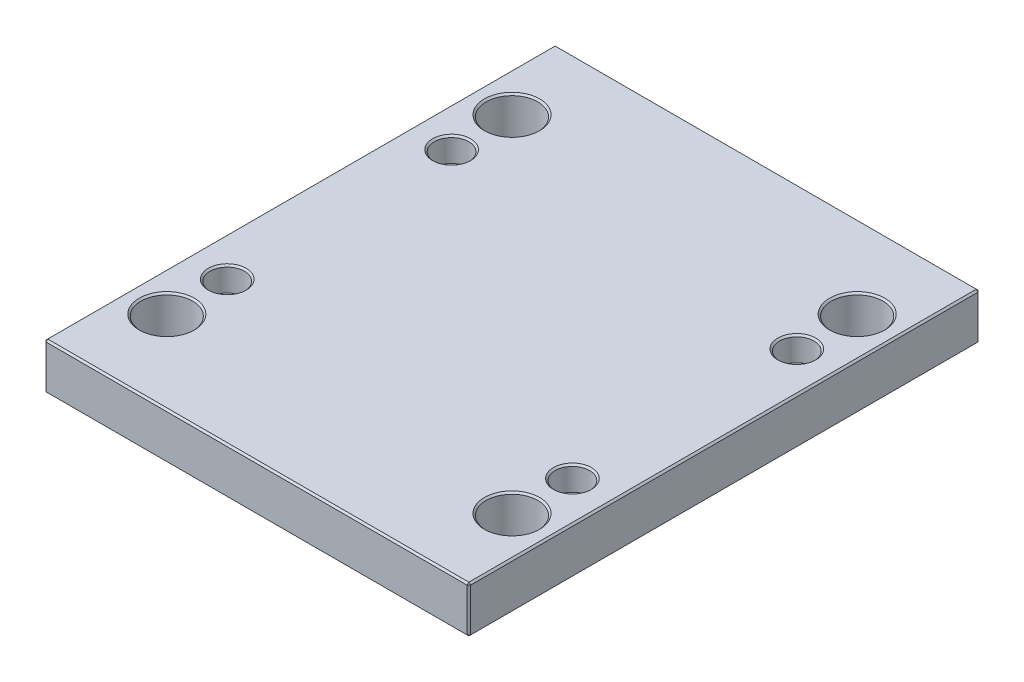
ISO-10303-21;
HEADER;
FILE_DESCRIPTION(('STEP AP214'),'2;1');
FILE_NAME('part.step','',(''),(''),'','','');
FILE_SCHEMA(('AUTOMOTIVE_DESIGN { 1 0 10303 214 1 1 1 1 }'));
ENDSEC;
DATA;
#1=APPLICATION_CONTEXT('core data for automotive mechanical design processes');
#2=APPLICATION_PROTOCOL_DEFINITION('international standard','automotive_design',2000,#1);
#3=PRODUCT_CONTEXT('',#1,'mechanical');
#4=PRODUCT('Part','Part','',(#3));
#5=PRODUCT_RELATED_PRODUCT_CATEGORY('part','',(#4));
#6=PRODUCT_DEFINITION_FORMATION('','',#4);
#7=PRODUCT_DEFINITION_CONTEXT('part definition',#1,'design');
#8=PRODUCT_DEFINITION('design','',#6,#7);
#9=PRODUCT_DEFINITION_SHAPE('','',#8);
#10=(LENGTH_UNIT() NAMED_UNIT(*) SI_UNIT(.MILLI.,.METRE.));
#11=(NAMED_UNIT(*) PLANE_ANGLE_UNIT() SI_UNIT($,.RADIAN.));
#12=(NAMED_UNIT(*) SI_UNIT($,.STERADIAN.) SOLID_ANGLE_UNIT());
#13=UNCERTAINTY_MEASURE_WITH_UNIT(LENGTH_MEASURE(1.E-05),#10,'distance_accuracy_value','');
#14=(GEOMETRIC_REPRESENTATION_CONTEXT(3) GLOBAL_UNCERTAINTY_ASSIGNED_CONTEXT((#13)) GLOBAL_UNIT_ASSIGNED_CONTEXT((#10,
#11,#12)) REPRESENTATION_CONTEXT('',''));
#15=CARTESIAN_POINT('',(0.,0.,0.));
#16=DIRECTION('',(0.,0.,1.));
#17=DIRECTION('',(1.,0.,0.));
#18=AXIS2_PLACEMENT_3D('',#15,#16,#17);
#19=CARTESIAN_POINT('',(-123.,27.,148.));
#20=DIRECTION('',(1.,0.,0.));
#21=DIRECTION('',(0.,0.,-1.));
#22=AXIS2_PLACEMENT_3D('',#19,#20,#21);
#23=PLANE('',#22);
#24=DIRECTION('',(0.,-1.,0.));
#25=VECTOR('',#24,1.);
#26=CARTESIAN_POINT('',(-123.,27.,-147.));
#27=LINE('',#26,#25);
#28=CARTESIAN_POINT('',(-123.,26.,-147.));
#29=VERTEX_POINT('',#28);
#30=CARTESIAN_POINT('',(-123.,0.999999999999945,-147.));
#31=VERTEX_POINT('',#30);
#32=EDGE_CURVE('E115',#29,#31,#27,.T.);
#33=ORIENTED_EDGE('',*,*,#32,.T.);
#34=DIRECTION('',(0.,0.,1.));
#35=VECTOR('',#34,1.);
#36=CARTESIAN_POINT('',(-123.,0.999999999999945,148.));
#37=LINE('',#36,#35);
#38=CARTESIAN_POINT('',(-123.,0.999999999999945,147.));
#39=VERTEX_POINT('',#38);
#40=EDGE_CURVE('E111',#31,#39,#37,.T.);
#41=ORIENTED_EDGE('',*,*,#40,.T.);
#42=DIRECTION('',(0.,1.,0.));
#43=VECTOR('',#42,1.);
#44=CARTESIAN_POINT('',(-123.,27.,147.));
#45=LINE('',#44,#43);
#46=CARTESIAN_POINT('',(-123.,26.,147.));
#47=VERTEX_POINT('',#46);
#48=EDGE_CURVE('E104',#39,#47,#45,.T.);
#49=ORIENTED_EDGE('',*,*,#48,.T.);
#50=DIRECTION('',(0.,0.,-1.));
#51=VECTOR('',#50,1.);
#52=CARTESIAN_POINT('',(-123.,26.,-148.));
#53=LINE('',#52,#51);
#54=EDGE_CURVE('E108',#47,#29,#53,.T.);
#55=ORIENTED_EDGE('',*,*,#54,.T.);
#56=EDGE_LOOP('',(#33,#41,#49,#55));
#57=FACE_BOUND('',#56,.T.);
#58=ADVANCED_FACE('F16',(#57),#23,.F.);
#59=CARTESIAN_POINT('',(123.,27.,148.));
#60=DIRECTION('',(0.,0.,-1.));
#61=DIRECTION('',(-1.,0.,0.));
#62=AXIS2_PLACEMENT_3D('',#59,#60,#61);
#63=PLANE('',#62);
#64=DIRECTION('',(-1.,0.,0.));
#65=VECTOR('',#64,1.);
#66=CARTESIAN_POINT('',(-123.,26.,148.));
#67=LINE('',#66,#65);
#68=CARTESIAN_POINT('',(122.,26.,148.));
#69=VERTEX_POINT('',#68);
#70=CARTESIAN_POINT('',(-122.,26.,148.));
#71=VERTEX_POINT('',#70);
#72=EDGE_CURVE('E170',#69,#71,#67,.T.);
#73=ORIENTED_EDGE('',*,*,#72,.T.);
#74=DIRECTION('',(0.,-1.,0.));
#75=VECTOR('',#74,1.);
#76=CARTESIAN_POINT('',(-122.,27.,148.));
#77=LINE('',#76,#75);
#78=CARTESIAN_POINT('',(-122.,0.999999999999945,148.));
#79=VERTEX_POINT('',#78);
#80=EDGE_CURVE('E123',#71,#79,#77,.T.);
#81=ORIENTED_EDGE('',*,*,#80,.T.);
#82=DIRECTION('',(1.,0.,0.));
#83=VECTOR('',#82,1.);
#84=CARTESIAN_POINT('',(123.,0.999999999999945,148.));
#85=LINE('',#84,#83);
#86=CARTESIAN_POINT('',(122.,0.999999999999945,148.));
#87=VERTEX_POINT('',#86);
#88=EDGE_CURVE('E174',#79,#87,#85,.T.);
#89=ORIENTED_EDGE('',*,*,#88,.T.);
#90=DIRECTION('',(0.,1.,0.));
#91=VECTOR('',#90,1.);
#92=CARTESIAN_POINT('',(122.,27.,148.));
#93=LINE('',#92,#91);
#94=EDGE_CURVE('E172',#87,#69,#93,.T.);
#95=ORIENTED_EDGE('',*,*,#94,.T.);
#96=EDGE_LOOP('',(#73,#81,#89,#95));
#97=FACE_BOUND('',#96,.T.);
#98=ADVANCED_FACE('F413',(#97),#63,.F.);
#99=CARTESIAN_POINT('',(123.,27.,148.));
#100=DIRECTION('',(-1.,0.,0.));
#101=DIRECTION('',(0.,0.,1.));
#102=AXIS2_PLACEMENT_3D('',#99,#100,#101);
#103=PLANE('',#102);
#104=DIRECTION('',(0.,0.,-1.));
#105=VECTOR('',#104,1.);
#106=CARTESIAN_POINT('',(123.,0.999999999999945,148.));
#107=LINE('',#106,#105);
#108=CARTESIAN_POINT('',(123.,0.999999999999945,147.));
#109=VERTEX_POINT('',#108);
#110=CARTESIAN_POINT('',(123.,0.999999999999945,-147.));
#111=VERTEX_POINT('',#110);
#112=EDGE_CURVE('E165',#109,#111,#107,.T.);
#113=ORIENTED_EDGE('',*,*,#112,.T.);
#114=DIRECTION('',(0.,1.,0.));
#115=VECTOR('',#114,1.);
#116=CARTESIAN_POINT('',(123.,27.,-147.));
#117=LINE('',#116,#115);
#118=CARTESIAN_POINT('',(123.,26.,-147.));
#119=VERTEX_POINT('',#118);
#120=EDGE_CURVE('E167',#111,#119,#117,.T.);
#121=ORIENTED_EDGE('',*,*,#120,.T.);
#122=DIRECTION('',(0.,0.,1.));
#123=VECTOR('',#122,1.);
#124=CARTESIAN_POINT('',(123.,26.,148.));
#125=LINE('',#124,#123);
#126=CARTESIAN_POINT('',(123.,26.,147.));
#127=VERTEX_POINT('',#126);
#128=EDGE_CURVE('E161',#119,#127,#125,.T.);
#129=ORIENTED_EDGE('',*,*,#128,.T.);
#130=DIRECTION('',(0.,-1.,0.));
#131=VECTOR('',#130,1.);
#132=CARTESIAN_POINT('',(123.,27.,147.));
#133=LINE('',#132,#131);
#134=EDGE_CURVE('E163',#127,#109,#133,.T.);
#135=ORIENTED_EDGE('',*,*,#134,.T.);
#136=EDGE_LOOP('',(#113,#121,#129,#135));
#137=FACE_BOUND('',#136,.T.);
#138=ADVANCED_FACE('F406',(#137),#103,.F.);
#139=CARTESIAN_POINT('',(123.,27.,-148.));
#140=DIRECTION('',(0.,0.,1.));
#141=DIRECTION('',(1.,0.,0.));
#142=AXIS2_PLACEMENT_3D('',#139,#140,#141);
#143=PLANE('',#142);
#144=DIRECTION('',(0.,-1.,0.));
#145=VECTOR('',#144,1.);
#146=CARTESIAN_POINT('',(122.,27.,-148.));
#147=LINE('',#146,#145);
#148=CARTESIAN_POINT('',(122.,26.,-148.));
#149=VERTEX_POINT('',#148);
#150=CARTESIAN_POINT('',(122.,0.999999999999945,-148.));
#151=VERTEX_POINT('',#150);
#152=EDGE_CURVE('E154',#149,#151,#147,.T.);
#153=ORIENTED_EDGE('',*,*,#152,.T.);
#154=DIRECTION('',(-1.,0.,0.));
#155=VECTOR('',#154,1.);
#156=CARTESIAN_POINT('',(123.,0.999999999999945,-148.));
#157=LINE('',#156,#155);
#158=CARTESIAN_POINT('',(-122.,0.999999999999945,-148.));
#159=VERTEX_POINT('',#158);
#160=EDGE_CURVE('E159',#151,#159,#157,.T.);
#161=ORIENTED_EDGE('',*,*,#160,.T.);
#162=DIRECTION('',(0.,1.,0.));
#163=VECTOR('',#162,1.);
#164=CARTESIAN_POINT('',(-122.,27.,-148.));
#165=LINE('',#164,#163);
#166=CARTESIAN_POINT('',(-122.,26.,-148.));
#167=VERTEX_POINT('',#166);
#168=EDGE_CURVE('E156',#159,#167,#165,.T.);
#169=ORIENTED_EDGE('',*,*,#168,.T.);
#170=DIRECTION('',(1.,0.,0.));
#171=VECTOR('',#170,1.);
#172=CARTESIAN_POINT('',(123.,26.,-148.));
#173=LINE('',#172,#171);
#174=EDGE_CURVE('E152',#167,#149,#173,.T.);
#175=ORIENTED_EDGE('',*,*,#174,.T.);
#176=EDGE_LOOP('',(#153,#161,#169,#175));
#177=FACE_BOUND('',#176,.T.);
#178=ADVANCED_FACE('F431',(#177),#143,.F.);
#179=CARTESIAN_POINT('',(0.,27.,0.));
#180=DIRECTION('',(0.,1.,0.));
#181=DIRECTION('',(0.,0.,1.));
#182=AXIS2_PLACEMENT_3D('',#179,#180,#181);
#183=PLANE('',#182);
#184=CARTESIAN_POINT('',(-100.,27.,100.));
#185=DIRECTION('',(0.,1.,0.));
#186=DIRECTION('',(0.,0.,1.));
#187=AXIS2_PLACEMENT_3D('',#184,#185,#186);
#188=CIRCLE('',#187,16.);
#189=CARTESIAN_POINT('',(-100.,27.,116.));
#190=VERTEX_POINT('',#189);
#191=EDGE_CURVE('E317',#190,#190,#188,.F.);
#192=ORIENTED_EDGE('',*,*,#191,.T.);
#193=EDGE_LOOP('',(#192));
#194=FACE_BOUND('',#193,.T.);
#195=CARTESIAN_POINT('',(100.,27.,100.));
#196=DIRECTION('',(0.,1.,0.));
#197=DIRECTION('',(0.,0.,1.));
#198=AXIS2_PLACEMENT_3D('',#195,#196,#197);
#199=CIRCLE('',#198,16.);
#200=CARTESIAN_POINT('',(100.,27.,116.));
#201=VERTEX_POINT('',#200);
#202=EDGE_CURVE('E314',#201,#201,#199,.F.);
#203=ORIENTED_EDGE('',*,*,#202,.T.);
#204=EDGE_LOOP('',(#203));
#205=FACE_BOUND('',#204,.T.);
#206=CARTESIAN_POINT('',(100.,27.,-100.));
#207=DIRECTION('',(0.,1.,0.));
#208=DIRECTION('',(0.,0.,1.));
#209=AXIS2_PLACEMENT_3D('',#206,#207,#208);
#210=CIRCLE('',#209,16.);
#211=CARTESIAN_POINT('',(100.,27.,-84.));
#212=VERTEX_POINT('',#211);
#213=EDGE_CURVE('E311',#212,#212,#210,.F.);
#214=ORIENTED_EDGE('',*,*,#213,.T.);
#215=EDGE_LOOP('',(#214));
#216=FACE_BOUND('',#215,.T.);
#217=CARTESIAN_POINT('',(-100.,27.,-100.));
#218=DIRECTION('',(0.,1.,0.));
#219=DIRECTION('',(0.,0.,1.));
#220=AXIS2_PLACEMENT_3D('',#217,#218,#219);
#221=CIRCLE('',#220,16.);
#222=CARTESIAN_POINT('',(-100.,27.,-84.));
#223=VERTEX_POINT('',#222);
#224=EDGE_CURVE('E308',#223,#223,#221,.F.);
#225=ORIENTED_EDGE('',*,*,#224,.T.);
#226=EDGE_LOOP('',(#225));
#227=FACE_BOUND('',#226,.T.);
#228=CARTESIAN_POINT('',(-100.,27.,65.));
#229=DIRECTION('',(0.,1.,0.));
#230=DIRECTION('',(0.,0.,1.));
#231=AXIS2_PLACEMENT_3D('',#228,#229,#230);
#232=CIRCLE('',#231,11.);
#233=CARTESIAN_POINT('',(-100.,27.,76.));
#234=VERTEX_POINT('',#233);
#235=EDGE_CURVE('E290',#234,#234,#232,.F.);
#236=ORIENTED_EDGE('',*,*,#235,.T.);
#237=EDGE_LOOP('',(#236));
#238=FACE_BOUND('',#237,.T.);
#239=CARTESIAN_POINT('',(100.,27.,65.));
#240=DIRECTION('',(0.,1.,0.));
#241=DIRECTION('',(0.,0.,1.));
#242=AXIS2_PLACEMENT_3D('',#239,#240,#241);
#243=CIRCLE('',#242,11.);
#244=CARTESIAN_POINT('',(100.,27.,76.));
#245=VERTEX_POINT('',#244);
#246=EDGE_CURVE('E287',#245,#245,#243,.F.);
#247=ORIENTED_EDGE('',*,*,#246,.T.);
#248=EDGE_LOOP('',(#247));
#249=FACE_BOUND('',#248,.T.);
#250=CARTESIAN_POINT('',(100.,27.,-65.));
#251=DIRECTION('',(0.,1.,0.));
#252=DIRECTION('',(0.,0.,1.));
#253=AXIS2_PLACEMENT_3D('',#250,#251,#252);
#254=CIRCLE('',#253,11.);
#255=CARTESIAN_POINT('',(100.,27.,-54.));
#256=VERTEX_POINT('',#255);
#257=EDGE_CURVE('E284',#256,#256,#254,.F.);
#258=ORIENTED_EDGE('',*,*,#257,.T.);
#259=EDGE_LOOP('',(#258));
#260=FACE_BOUND('',#259,.T.);
#261=CARTESIAN_POINT('',(-100.,27.,-65.));
#262=DIRECTION('',(0.,1.,0.));
#263=DIRECTION('',(0.,0.,1.));
#264=AXIS2_PLACEMENT_3D('',#261,#262,#263);
#265=CIRCLE('',#264,11.);
#266=CARTESIAN_POINT('',(-100.,27.,-54.));
#267=VERTEX_POINT('',#266);
#268=EDGE_CURVE('E281',#267,#267,#265,.F.);
#269=ORIENTED_EDGE('',*,*,#268,.T.);
#270=EDGE_LOOP('',(#269));
#271=FACE_BOUND('',#270,.T.);
#272=DIRECTION('',(0.,0.,-1.));
#273=VECTOR('',#272,1.);
#274=CARTESIAN_POINT('',(122.,27.,-148.));
#275=LINE('',#274,#273);
#276=CARTESIAN_POINT('',(122.,27.,147.));
#277=VERTEX_POINT('',#276);
#278=CARTESIAN_POINT('',(122.,27.,-147.));
#279=VERTEX_POINT('',#278);
#280=EDGE_CURVE('E31',#277,#279,#275,.T.);
#281=ORIENTED_EDGE('',*,*,#280,.T.);
#282=DIRECTION('',(-1.,0.,0.));
#283=VECTOR('',#282,1.);
#284=CARTESIAN_POINT('',(-123.,27.,-147.));
#285=LINE('',#284,#283);
#286=CARTESIAN_POINT('',(-122.,27.,-147.));
#287=VERTEX_POINT('',#286);
#288=EDGE_CURVE('E190',#279,#287,#285,.T.);
#289=ORIENTED_EDGE('',*,*,#288,.T.);
#290=DIRECTION('',(0.,0.,1.));
#291=VECTOR('',#290,1.);
#292=CARTESIAN_POINT('',(-122.,27.,148.));
#293=LINE('',#292,#291);
#294=CARTESIAN_POINT('',(-122.,27.,147.));
#295=VERTEX_POINT('',#294);
#296=EDGE_CURVE('E186',#287,#295,#293,.T.);
#297=ORIENTED_EDGE('',*,*,#296,.T.);
#298=DIRECTION('',(1.,0.,0.));
#299=VECTOR('',#298,1.);
#300=CARTESIAN_POINT('',(123.,27.,147.));
#301=LINE('',#300,#299);
#302=EDGE_CURVE('E36',#295,#277,#301,.T.);
#303=ORIENTED_EDGE('',*,*,#302,.T.);
#304=EDGE_LOOP('',(#281,#289,#297,#303));
#305=FACE_BOUND('',#304,.T.);
#306=ADVANCED_FACE('F357',(#194,#205,#216,#227,#238,#249,#260,#271,#305),#183,.T.);
#307=CARTESIAN_POINT('',(0.,0.,0.));
#308=DIRECTION('',(0.,1.,0.));
#309=DIRECTION('',(0.,0.,1.));
#310=AXIS2_PLACEMENT_3D('',#307,#308,#309);
#311=PLANE('',#310);
#312=CARTESIAN_POINT('',(-100.,0.,100.));
#313=DIRECTION('',(0.,1.,0.));
#314=DIRECTION('',(0.,0.,1.));
#315=AXIS2_PLACEMENT_3D('',#312,#313,#314);
#316=CIRCLE('',#315,16.);
#317=CARTESIAN_POINT('',(-100.,0.,116.));
#318=VERTEX_POINT('',#317);
#319=EDGE_CURVE('E329',#318,#318,#316,.T.);
#320=ORIENTED_EDGE('',*,*,#319,.T.);
#321=EDGE_LOOP('',(#320));
#322=FACE_BOUND('',#321,.T.);
#323=CARTESIAN_POINT('',(100.,0.,100.));
#324=DIRECTION('',(0.,1.,0.));
#325=DIRECTION('',(0.,0.,1.));
#326=AXIS2_PLACEMENT_3D('',#323,#324,#325);
#327=CIRCLE('',#326,16.);
#328=CARTESIAN_POINT('',(100.,0.,116.));
#329=VERTEX_POINT('',#328);
#330=EDGE_CURVE('E326',#329,#329,#327,.T.);
#331=ORIENTED_EDGE('',*,*,#330,.T.);
#332=EDGE_LOOP('',(#331));
#333=FACE_BOUND('',#332,.T.);
#334=CARTESIAN_POINT('',(100.,0.,-100.));
#335=DIRECTION('',(0.,1.,0.));
#336=DIRECTION('',(0.,0.,1.));
#337=AXIS2_PLACEMENT_3D('',#334,#335,#336);
#338=CIRCLE('',#337,16.);
#339=CARTESIAN_POINT('',(100.,0.,-84.));
#340=VERTEX_POINT('',#339);
#341=EDGE_CURVE('E323',#340,#340,#338,.T.);
#342=ORIENTED_EDGE('',*,*,#341,.T.);
#343=EDGE_LOOP('',(#342));
#344=FACE_BOUND('',#343,.T.);
#345=CARTESIAN_POINT('',(-100.,0.,-100.));
#346=DIRECTION('',(0.,1.,0.));
#347=DIRECTION('',(0.,0.,1.));
#348=AXIS2_PLACEMENT_3D('',#345,#346,#347);
#349=CIRCLE('',#348,16.);
#350=CARTESIAN_POINT('',(-100.,0.,-84.));
#351=VERTEX_POINT('',#350);
#352=EDGE_CURVE('E320',#351,#351,#349,.T.);
#353=ORIENTED_EDGE('',*,*,#352,.T.);
#354=EDGE_LOOP('',(#353));
#355=FACE_BOUND('',#354,.T.);
#356=CARTESIAN_POINT('',(100.,0.,-65.));
#357=DIRECTION('',(0.,1.,0.));
#358=DIRECTION('',(0.,0.,1.));
#359=AXIS2_PLACEMENT_3D('',#356,#357,#358);
#360=CIRCLE('',#359,8.);
#361=CARTESIAN_POINT('',(100.,0.,-57.));
#362=VERTEX_POINT('',#361);
#363=EDGE_CURVE('E263',#362,#362,#360,.T.);
#364=ORIENTED_EDGE('',*,*,#363,.T.);
#365=EDGE_LOOP('',(#364));
#366=FACE_BOUND('',#365,.T.);
#367=CARTESIAN_POINT('',(100.,0.,65.));
#368=DIRECTION('',(0.,1.,0.));
#369=DIRECTION('',(0.,0.,1.));
#370=AXIS2_PLACEMENT_3D('',#367,#368,#369);
#371=CIRCLE('',#370,8.);
#372=CARTESIAN_POINT('',(100.,0.,73.));
#373=VERTEX_POINT('',#372);
#374=EDGE_CURVE('E260',#373,#373,#371,.T.);
#375=ORIENTED_EDGE('',*,*,#374,.T.);
#376=EDGE_LOOP('',(#375));
#377=FACE_BOUND('',#376,.T.);
#378=CARTESIAN_POINT('',(-100.,0.,65.));
#379=DIRECTION('',(0.,1.,0.));
#380=DIRECTION('',(0.,0.,1.));
#381=AXIS2_PLACEMENT_3D('',#378,#379,#380);
#382=CIRCLE('',#381,8.);
#383=CARTESIAN_POINT('',(-100.,0.,73.));
#384=VERTEX_POINT('',#383);
#385=EDGE_CURVE('E257',#384,#384,#382,.T.);
#386=ORIENTED_EDGE('',*,*,#385,.T.);
#387=EDGE_LOOP('',(#386));
#388=FACE_BOUND('',#387,.T.);
#389=CARTESIAN_POINT('',(-100.,0.,-65.));
#390=DIRECTION('',(0.,1.,0.));
#391=DIRECTION('',(0.,0.,1.));
#392=AXIS2_PLACEMENT_3D('',#389,#390,#391);
#393=CIRCLE('',#392,8.);
#394=CARTESIAN_POINT('',(-100.,0.,-57.));
#395=VERTEX_POINT('',#394);
#396=EDGE_CURVE('E192',#395,#395,#393,.T.);
#397=ORIENTED_EDGE('',*,*,#396,.T.);
#398=EDGE_LOOP('',(#397));
#399=FACE_BOUND('',#398,.T.);
#400=DIRECTION('',(0.,0.,1.));
#401=VECTOR('',#400,1.);
#402=CARTESIAN_POINT('',(122.,0.,0.));
#403=LINE('',#402,#401);
#404=CARTESIAN_POINT('',(122.,0.,-147.));
#405=VERTEX_POINT('',#404);
#406=CARTESIAN_POINT('',(122.,0.,147.));
#407=VERTEX_POINT('',#406);
#408=EDGE_CURVE('E177',#405,#407,#403,.T.);
#409=ORIENTED_EDGE('',*,*,#408,.T.);
#410=DIRECTION('',(-1.,0.,0.));
#411=VECTOR('',#410,1.);
#412=CARTESIAN_POINT('',(0.,0.,147.));
#413=LINE('',#412,#411);
#414=CARTESIAN_POINT('',(-122.,0.,147.));
#415=VERTEX_POINT('',#414);
#416=EDGE_CURVE('E183',#407,#415,#413,.T.);
#417=ORIENTED_EDGE('',*,*,#416,.T.);
#418=DIRECTION('',(0.,0.,-1.));
#419=VECTOR('',#418,1.);
#420=CARTESIAN_POINT('',(-122.,0.,0.));
#421=LINE('',#420,#419);
#422=CARTESIAN_POINT('',(-122.,0.,-147.));
#423=VERTEX_POINT('',#422);
#424=EDGE_CURVE('E181',#415,#423,#421,.T.);
#425=ORIENTED_EDGE('',*,*,#424,.T.);
#426=DIRECTION('',(1.,0.,0.));
#427=VECTOR('',#426,1.);
#428=CARTESIAN_POINT('',(0.,0.,-147.));
#429=LINE('',#428,#427);
#430=EDGE_CURVE('E179',#423,#405,#429,.T.);
#431=ORIENTED_EDGE('',*,*,#430,.T.);
#432=EDGE_LOOP('',(#409,#417,#425,#431));
#433=FACE_BOUND('',#432,.T.);
#434=ADVANCED_FACE('F353',(#322,#333,#344,#355,#366,#377,#388,#399,#433),#311,.F.);
#435=CARTESIAN_POINT('',(123.,27.,147.));
#436=DIRECTION('',(-0.707106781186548,0.,-0.707106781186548));
#437=DIRECTION('',(0.,-1.,0.));
#438=AXIS2_PLACEMENT_3D('',#435,#436,#437);
#439=PLANE('',#438);
#440=DIRECTION('',(-0.707106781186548,0.,0.707106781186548));
#441=VECTOR('',#440,1.);
#442=CARTESIAN_POINT('',(122.,26.,148.));
#443=LINE('',#442,#441);
#444=EDGE_CURVE('E141',#69,#127,#443,.F.);
#445=ORIENTED_EDGE('',*,*,#444,.F.);
#446=ORIENTED_EDGE('',*,*,#94,.F.);
#447=DIRECTION('',(0.707106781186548,0.,-0.707106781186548));
#448=VECTOR('',#447,1.);
#449=CARTESIAN_POINT('',(122.,0.999999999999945,148.));
#450=LINE('',#449,#448);
#451=EDGE_CURVE('E144',#109,#87,#450,.F.);
#452=ORIENTED_EDGE('',*,*,#451,.F.);
#453=ORIENTED_EDGE('',*,*,#134,.F.);
#454=EDGE_LOOP('',(#445,#446,#452,#453));
#455=FACE_BOUND('',#454,.T.);
#456=ADVANCED_FACE('F356',(#455),#439,.F.);
#457=CARTESIAN_POINT('',(122.,26.,148.));
#458=DIRECTION('',(0.577350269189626,0.577350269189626,0.577350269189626));
#459=DIRECTION('',(0.707106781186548,0.,-0.707106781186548));
#460=AXIS2_PLACEMENT_3D('',#457,#458,#459);
#461=PLANE('',#460);
#462=DIRECTION('',(0.,-0.707106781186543,0.707106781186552));
#463=VECTOR('',#462,1.);
#464=CARTESIAN_POINT('',(122.,26.,148.));
#465=LINE('',#464,#463);
#466=EDGE_CURVE('E235',#69,#277,#465,.F.);
#467=ORIENTED_EDGE('',*,*,#466,.F.);
#468=ORIENTED_EDGE('',*,*,#444,.T.);
#469=DIRECTION('',(-0.707106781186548,0.707106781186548,0.));
#470=VECTOR('',#469,1.);
#471=CARTESIAN_POINT('',(122.5,26.5,147.));
#472=LINE('',#471,#470);
#473=EDGE_CURVE('E237',#277,#127,#472,.F.);
#474=ORIENTED_EDGE('',*,*,#473,.F.);
#475=EDGE_LOOP('',(#467,#468,#474));
#476=FACE_BOUND('',#475,.T.);
#477=ADVANCED_FACE('F419',(#476),#461,.T.);
#478=CARTESIAN_POINT('',(122.,0.999999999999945,148.));
#479=DIRECTION('',(0.577350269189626,-0.577350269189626,0.577350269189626));
#480=DIRECTION('',(0.707106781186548,0.,-0.707106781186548));
#481=AXIS2_PLACEMENT_3D('',#478,#479,#480);
#482=PLANE('',#481);
#483=DIRECTION('',(-0.707106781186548,-0.707106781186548,0.));
#484=VECTOR('',#483,1.);
#485=CARTESIAN_POINT('',(122.5,0.499999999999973,147.));
#486=LINE('',#485,#484);
#487=EDGE_CURVE('E229',#109,#407,#486,.T.);
#488=ORIENTED_EDGE('',*,*,#487,.F.);
#489=ORIENTED_EDGE('',*,*,#451,.T.);
#490=DIRECTION('',(0.,0.707106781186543,0.707106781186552));
#491=VECTOR('',#490,1.);
#492=CARTESIAN_POINT('',(122.,0.999999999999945,148.));
#493=LINE('',#492,#491);
#494=EDGE_CURVE('E232',#407,#87,#493,.T.);
#495=ORIENTED_EDGE('',*,*,#494,.F.);
#496=EDGE_LOOP('',(#488,#489,#495));
#497=FACE_BOUND('',#496,.T.);
#498=ADVANCED_FACE('F378',(#497),#482,.T.);
#499=CARTESIAN_POINT('',(122.,27.,0.));
#500=DIRECTION('',(0.707106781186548,0.707106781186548,0.));
#501=DIRECTION('',(0.,0.,1.));
#502=AXIS2_PLACEMENT_3D('',#499,#500,#501);
#503=PLANE('',#502);
#504=ORIENTED_EDGE('',*,*,#473,.T.);
#505=ORIENTED_EDGE('',*,*,#128,.F.);
#506=DIRECTION('',(0.707106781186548,-0.707106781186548,0.));
#507=VECTOR('',#506,1.);
#508=CARTESIAN_POINT('',(123.,26.,-147.));
#509=LINE('',#508,#507);
#510=EDGE_CURVE('E224',#279,#119,#509,.T.);
#511=ORIENTED_EDGE('',*,*,#510,.F.);
#512=ORIENTED_EDGE('',*,*,#280,.F.);
#513=EDGE_LOOP('',(#504,#505,#511,#512));
#514=FACE_BOUND('',#513,.T.);
#515=ADVANCED_FACE('F421',(#514),#503,.T.);
#516=CARTESIAN_POINT('',(0.,27.,147.));
#517=DIRECTION('',(0.,0.707106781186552,0.707106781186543));
#518=DIRECTION('',(-1.,0.,0.));
#519=AXIS2_PLACEMENT_3D('',#516,#517,#518);
#520=PLANE('',#519);
#521=ORIENTED_EDGE('',*,*,#466,.T.);
#522=ORIENTED_EDGE('',*,*,#302,.F.);
#523=DIRECTION('',(0.,0.707106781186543,-0.707106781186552));
#524=VECTOR('',#523,1.);
#525=CARTESIAN_POINT('',(-122.,26.5,147.5));
#526=LINE('',#525,#524);
#527=EDGE_CURVE('E127',#71,#295,#526,.T.);
#528=ORIENTED_EDGE('',*,*,#527,.F.);
#529=ORIENTED_EDGE('',*,*,#72,.F.);
#530=EDGE_LOOP('',(#521,#522,#528,#529));
#531=FACE_BOUND('',#530,.T.);
#532=ADVANCED_FACE('F416',(#531),#520,.T.);
#533=CARTESIAN_POINT('',(-122.,27.,148.));
#534=DIRECTION('',(0.707106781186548,0.,-0.707106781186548));
#535=DIRECTION('',(0.,-1.,0.));
#536=AXIS2_PLACEMENT_3D('',#533,#534,#535);
#537=PLANE('',#536);
#538=DIRECTION('',(0.707106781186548,0.,0.707106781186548));
#539=VECTOR('',#538,1.);
#540=CARTESIAN_POINT('',(-122.,0.999999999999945,148.));
#541=LINE('',#540,#539);
#542=EDGE_CURVE('E128',#79,#39,#541,.F.);
#543=ORIENTED_EDGE('',*,*,#542,.F.);
#544=ORIENTED_EDGE('',*,*,#80,.F.);
#545=DIRECTION('',(-0.707106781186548,0.,-0.707106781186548));
#546=VECTOR('',#545,1.);
#547=CARTESIAN_POINT('',(-123.,26.,147.));
#548=LINE('',#547,#546);
#549=EDGE_CURVE('E119',#47,#71,#548,.F.);
#550=ORIENTED_EDGE('',*,*,#549,.F.);
#551=ORIENTED_EDGE('',*,*,#48,.F.);
#552=EDGE_LOOP('',(#543,#544,#550,#551));
#553=FACE_BOUND('',#552,.T.);
#554=ADVANCED_FACE('F121',(#553),#537,.F.);
#555=CARTESIAN_POINT('',(123.,0.999999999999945,148.));
#556=DIRECTION('',(0.,0.707106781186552,-0.707106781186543));
#557=DIRECTION('',(1.,0.,0.));
#558=AXIS2_PLACEMENT_3D('',#555,#556,#557);
#559=PLANE('',#558);
#560=ORIENTED_EDGE('',*,*,#494,.T.);
#561=ORIENTED_EDGE('',*,*,#88,.F.);
#562=DIRECTION('',(0.,-0.707106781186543,-0.707106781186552));
#563=VECTOR('',#562,1.);
#564=CARTESIAN_POINT('',(-122.,0.999999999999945,148.));
#565=LINE('',#564,#563);
#566=EDGE_CURVE('E220',#415,#79,#565,.F.);
#567=ORIENTED_EDGE('',*,*,#566,.F.);
#568=ORIENTED_EDGE('',*,*,#416,.F.);
#569=EDGE_LOOP('',(#560,#561,#567,#568));
#570=FACE_BOUND('',#569,.T.);
#571=ADVANCED_FACE('F383',(#570),#559,.F.);
#572=CARTESIAN_POINT('',(123.,0.999999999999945,148.));
#573=DIRECTION('',(-0.707106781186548,0.707106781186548,0.));
#574=DIRECTION('',(0.,0.,-1.));
#575=AXIS2_PLACEMENT_3D('',#572,#573,#574);
#576=PLANE('',#575);
#577=ORIENTED_EDGE('',*,*,#487,.T.);
#578=ORIENTED_EDGE('',*,*,#408,.F.);
#579=DIRECTION('',(0.707106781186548,0.707106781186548,0.));
#580=VECTOR('',#579,1.);
#581=CARTESIAN_POINT('',(122.5,0.499999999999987,-147.));
#582=LINE('',#581,#580);
#583=EDGE_CURVE('E217',#111,#405,#582,.F.);
#584=ORIENTED_EDGE('',*,*,#583,.F.);
#585=ORIENTED_EDGE('',*,*,#112,.F.);
#586=EDGE_LOOP('',(#577,#578,#584,#585));
#587=FACE_BOUND('',#586,.T.);
#588=ADVANCED_FACE('F376',(#587),#576,.F.);
#589=CARTESIAN_POINT('',(122.,27.,-148.));
#590=DIRECTION('',(-0.707106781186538,0.,0.707106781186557));
#591=DIRECTION('',(0.,-1.,0.));
#592=AXIS2_PLACEMENT_3D('',#589,#590,#591);
#593=PLANE('',#592);
#594=DIRECTION('',(0.707106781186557,0.,0.707106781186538));
#595=VECTOR('',#594,1.);
#596=CARTESIAN_POINT('',(123.,26.,-147.));
#597=LINE('',#596,#595);
#598=EDGE_CURVE('E226',#119,#149,#597,.F.);
#599=ORIENTED_EDGE('',*,*,#598,.F.);
#600=ORIENTED_EDGE('',*,*,#120,.F.);
#601=DIRECTION('',(-0.707106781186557,0.,-0.707106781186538));
#602=VECTOR('',#601,1.);
#603=CARTESIAN_POINT('',(122.,0.999999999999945,-148.));
#604=LINE('',#603,#602);
#605=EDGE_CURVE('E214',#151,#111,#604,.F.);
#606=ORIENTED_EDGE('',*,*,#605,.F.);
#607=ORIENTED_EDGE('',*,*,#152,.F.);
#608=EDGE_LOOP('',(#599,#600,#606,#607));
#609=FACE_BOUND('',#608,.T.);
#610=ADVANCED_FACE('F403',(#609),#593,.F.);
#611=CARTESIAN_POINT('',(123.,26.,-147.));
#612=DIRECTION('',(0.577350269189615,0.577350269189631,-0.577350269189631));
#613=DIRECTION('',(0.,0.707106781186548,0.707106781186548));
#614=AXIS2_PLACEMENT_3D('',#611,#612,#613);
#615=PLANE('',#614);
#616=ORIENTED_EDGE('',*,*,#510,.T.);
#617=ORIENTED_EDGE('',*,*,#598,.T.);
#618=DIRECTION('',(0.,0.707106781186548,0.707106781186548));
#619=VECTOR('',#618,1.);
#620=CARTESIAN_POINT('',(122.,26.5,-147.5));
#621=LINE('',#620,#619);
#622=EDGE_CURVE('E135',#279,#149,#621,.F.);
#623=ORIENTED_EDGE('',*,*,#622,.F.);
#624=EDGE_LOOP('',(#616,#617,#623));
#625=FACE_BOUND('',#624,.T.);
#626=ADVANCED_FACE('F425',(#625),#615,.T.);
#627=CARTESIAN_POINT('',(-123.,26.,147.));
#628=DIRECTION('',(-0.577350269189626,0.577350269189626,0.577350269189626));
#629=DIRECTION('',(0.707106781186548,0.,0.707106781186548));
#630=AXIS2_PLACEMENT_3D('',#627,#628,#629);
#631=PLANE('',#630);
#632=ORIENTED_EDGE('',*,*,#549,.T.);
#633=ORIENTED_EDGE('',*,*,#527,.T.);
#634=DIRECTION('',(-0.707106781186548,-0.707106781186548,0.));
#635=VECTOR('',#634,1.);
#636=CARTESIAN_POINT('',(-123.,26.,147.));
#637=LINE('',#636,#635);
#638=EDGE_CURVE('E131',#47,#295,#637,.F.);
#639=ORIENTED_EDGE('',*,*,#638,.F.);
#640=EDGE_LOOP('',(#632,#633,#639));
#641=FACE_BOUND('',#640,.T.);
#642=ADVANCED_FACE('F132',(#641),#631,.T.);
#643=CARTESIAN_POINT('',(-122.,0.999999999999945,148.));
#644=DIRECTION('',(-0.577350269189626,-0.577350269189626,0.577350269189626));
#645=DIRECTION('',(0.707106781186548,0.,0.707106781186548));
#646=AXIS2_PLACEMENT_3D('',#643,#644,#645);
#647=PLANE('',#646);
#648=ORIENTED_EDGE('',*,*,#566,.T.);
#649=ORIENTED_EDGE('',*,*,#542,.T.);
#650=DIRECTION('',(-0.707106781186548,0.707106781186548,0.));
#651=VECTOR('',#650,1.);
#652=CARTESIAN_POINT('',(-122.5,0.499999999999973,147.));
#653=LINE('',#652,#651);
#654=EDGE_CURVE('E136',#415,#39,#653,.T.);
#655=ORIENTED_EDGE('',*,*,#654,.F.);
#656=EDGE_LOOP('',(#648,#649,#655));
#657=FACE_BOUND('',#656,.T.);
#658=ADVANCED_FACE('F386',(#657),#647,.T.);
#659=CARTESIAN_POINT('',(122.,0.999999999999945,-148.));
#660=DIRECTION('',(0.577350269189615,-0.577350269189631,-0.577350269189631));
#661=DIRECTION('',(0.,0.707106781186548,-0.707106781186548));
#662=AXIS2_PLACEMENT_3D('',#659,#660,#661);
#663=PLANE('',#662);
#664=ORIENTED_EDGE('',*,*,#605,.T.);
#665=ORIENTED_EDGE('',*,*,#583,.T.);
#666=DIRECTION('',(0.,-0.707106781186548,0.707106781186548));
#667=VECTOR('',#666,1.);
#668=CARTESIAN_POINT('',(122.,0.999999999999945,-148.));
#669=LINE('',#668,#667);
#670=EDGE_CURVE('E207',#151,#405,#669,.T.);
#671=ORIENTED_EDGE('',*,*,#670,.F.);
#672=EDGE_LOOP('',(#664,#665,#671));
#673=FACE_BOUND('',#672,.T.);
#674=ADVANCED_FACE('F397',(#673),#663,.T.);
#675=CARTESIAN_POINT('',(0.,27.,-147.));
#676=DIRECTION('',(0.,0.707106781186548,-0.707106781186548));
#677=DIRECTION('',(1.,0.,0.));
#678=AXIS2_PLACEMENT_3D('',#675,#676,#677);
#679=PLANE('',#678);
#680=ORIENTED_EDGE('',*,*,#622,.T.);
#681=ORIENTED_EDGE('',*,*,#174,.F.);
#682=DIRECTION('',(0.,-0.707106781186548,-0.707106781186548));
#683=VECTOR('',#682,1.);
#684=CARTESIAN_POINT('',(-122.,26.,-148.));
#685=LINE('',#684,#683);
#686=EDGE_CURVE('E204',#287,#167,#685,.T.);
#687=ORIENTED_EDGE('',*,*,#686,.F.);
#688=ORIENTED_EDGE('',*,*,#288,.F.);
#689=EDGE_LOOP('',(#680,#681,#687,#688));
#690=FACE_BOUND('',#689,.T.);
#691=ADVANCED_FACE('F429',(#690),#679,.T.);
#692=CARTESIAN_POINT('',(-122.,27.,0.));
#693=DIRECTION('',(-0.707106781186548,0.707106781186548,0.));
#694=DIRECTION('',(0.,0.,-1.));
#695=AXIS2_PLACEMENT_3D('',#692,#693,#694);
#696=PLANE('',#695);
#697=ORIENTED_EDGE('',*,*,#638,.T.);
#698=ORIENTED_EDGE('',*,*,#296,.F.);
#699=DIRECTION('',(0.707106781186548,0.707106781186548,0.));
#700=VECTOR('',#699,1.);
#701=CARTESIAN_POINT('',(-122.5,26.5,-147.));
#702=LINE('',#701,#700);
#703=EDGE_CURVE('E139',#29,#287,#702,.T.);
#704=ORIENTED_EDGE('',*,*,#703,.F.);
#705=ORIENTED_EDGE('',*,*,#54,.F.);
#706=EDGE_LOOP('',(#697,#698,#704,#705));
#707=FACE_BOUND('',#706,.T.);
#708=ADVANCED_FACE('F138',(#707),#696,.T.);
#709=CARTESIAN_POINT('',(-123.,0.999999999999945,148.));
#710=DIRECTION('',(0.707106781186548,0.707106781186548,0.));
#711=DIRECTION('',(0.,0.,1.));
#712=AXIS2_PLACEMENT_3D('',#709,#710,#711);
#713=PLANE('',#712);
#714=ORIENTED_EDGE('',*,*,#654,.T.);
#715=ORIENTED_EDGE('',*,*,#40,.F.);
#716=DIRECTION('',(0.707106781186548,-0.707106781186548,0.));
#717=VECTOR('',#716,1.);
#718=CARTESIAN_POINT('',(-123.,0.999999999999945,-147.));
#719=LINE('',#718,#717);
#720=EDGE_CURVE('E200',#423,#31,#719,.F.);
#721=ORIENTED_EDGE('',*,*,#720,.F.);
#722=ORIENTED_EDGE('',*,*,#424,.F.);
#723=EDGE_LOOP('',(#714,#715,#721,#722));
#724=FACE_BOUND('',#723,.T.);
#725=ADVANCED_FACE('F388',(#724),#713,.F.);
#726=CARTESIAN_POINT('',(123.,0.999999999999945,-148.));
#727=DIRECTION('',(0.,0.707106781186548,0.707106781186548));
#728=DIRECTION('',(-1.,0.,0.));
#729=AXIS2_PLACEMENT_3D('',#726,#727,#728);
#730=PLANE('',#729);
#731=ORIENTED_EDGE('',*,*,#670,.T.);
#732=ORIENTED_EDGE('',*,*,#430,.F.);
#733=DIRECTION('',(0.,0.707106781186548,-0.707106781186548));
#734=VECTOR('',#733,1.);
#735=CARTESIAN_POINT('',(-122.,0.499999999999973,-147.5));
#736=LINE('',#735,#734);
#737=EDGE_CURVE('E197',#159,#423,#736,.F.);
#738=ORIENTED_EDGE('',*,*,#737,.F.);
#739=ORIENTED_EDGE('',*,*,#160,.F.);
#740=EDGE_LOOP('',(#731,#732,#738,#739));
#741=FACE_BOUND('',#740,.T.);
#742=ADVANCED_FACE('F392',(#741),#730,.F.);
#743=CARTESIAN_POINT('',(-122.,26.,-148.));
#744=DIRECTION('',(-0.577350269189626,0.577350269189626,-0.577350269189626));
#745=DIRECTION('',(-0.707106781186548,0.,0.707106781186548));
#746=AXIS2_PLACEMENT_3D('',#743,#744,#745);
#747=PLANE('',#746);
#748=ORIENTED_EDGE('',*,*,#703,.T.);
#749=ORIENTED_EDGE('',*,*,#686,.T.);
#750=DIRECTION('',(0.707106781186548,0.,-0.707106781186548));
#751=VECTOR('',#750,1.);
#752=CARTESIAN_POINT('',(-122.,26.,-148.));
#753=LINE('',#752,#751);
#754=EDGE_CURVE('E195',#29,#167,#753,.T.);
#755=ORIENTED_EDGE('',*,*,#754,.F.);
#756=EDGE_LOOP('',(#748,#749,#755));
#757=FACE_BOUND('',#756,.T.);
#758=ADVANCED_FACE('F460',(#757),#747,.T.);
#759=CARTESIAN_POINT('',(-123.,0.999999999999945,-147.));
#760=DIRECTION('',(-0.577350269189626,-0.577350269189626,-0.577350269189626));
#761=DIRECTION('',(-0.707106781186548,0.,0.707106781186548));
#762=AXIS2_PLACEMENT_3D('',#759,#760,#761);
#763=PLANE('',#762);
#764=ORIENTED_EDGE('',*,*,#737,.T.);
#765=ORIENTED_EDGE('',*,*,#720,.T.);
#766=DIRECTION('',(-0.707106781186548,0.,0.707106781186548));
#767=VECTOR('',#766,1.);
#768=CARTESIAN_POINT('',(-123.,0.999999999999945,-147.));
#769=LINE('',#768,#767);
#770=EDGE_CURVE('E193',#159,#31,#769,.T.);
#771=ORIENTED_EDGE('',*,*,#770,.F.);
#772=EDGE_LOOP('',(#764,#765,#771));
#773=FACE_BOUND('',#772,.T.);
#774=ADVANCED_FACE('F456',(#773),#763,.T.);
#775=CARTESIAN_POINT('',(-123.,27.,-147.));
#776=DIRECTION('',(0.707106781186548,0.,0.707106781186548));
#777=DIRECTION('',(0.,-1.,0.));
#778=AXIS2_PLACEMENT_3D('',#775,#776,#777);
#779=PLANE('',#778);
#780=ORIENTED_EDGE('',*,*,#754,.T.);
#781=ORIENTED_EDGE('',*,*,#168,.F.);
#782=ORIENTED_EDGE('',*,*,#770,.T.);
#783=ORIENTED_EDGE('',*,*,#32,.F.);
#784=EDGE_LOOP('',(#780,#781,#782,#783));
#785=FACE_BOUND('',#784,.T.);
#786=ADVANCED_FACE('F452',(#785),#779,.F.);
#787=CARTESIAN_POINT('',(-100.,13.,-65.));
#788=DIRECTION('',(0.,1.,0.));
#789=DIRECTION('',(0.,0.,1.));
#790=AXIS2_PLACEMENT_3D('',#787,#788,#789);
#791=CYLINDRICAL_SURFACE('',#790,10.);
#792=CARTESIAN_POINT('',(-100.,26.,-65.));
#793=DIRECTION('',(0.,1.,0.));
#794=DIRECTION('',(0.,0.,1.));
#795=AXIS2_PLACEMENT_3D('',#792,#793,#794);
#796=CIRCLE('',#795,10.);
#797=CARTESIAN_POINT('',(-100.,26.,-55.));
#798=VERTEX_POINT('',#797);
#799=EDGE_CURVE('E299',#798,#798,#796,.T.);
#800=ORIENTED_EDGE('',*,*,#799,.T.);
#801=EDGE_LOOP('',(#800));
#802=FACE_BOUND('',#801,.T.);
#803=CARTESIAN_POINT('',(-100.,13.,-65.));
#804=DIRECTION('',(0.,1.,0.));
#805=DIRECTION('',(0.,0.,1.));
#806=AXIS2_PLACEMENT_3D('',#803,#804,#805);
#807=CIRCLE('',#806,10.);
#808=CARTESIAN_POINT('',(-100.,13.,-55.));
#809=VERTEX_POINT('',#808);
#810=EDGE_CURVE('E147',#809,#809,#807,.T.);
#811=ORIENTED_EDGE('',*,*,#810,.F.);
#812=EDGE_LOOP('',(#811));
#813=FACE_BOUND('',#812,.T.);
#814=ADVANCED_FACE('F455',(#802,#813),#791,.F.);
#815=CARTESIAN_POINT('',(-100.,13.,-65.));
#816=DIRECTION('',(0.,1.,0.));
#817=DIRECTION('',(0.,0.,1.));
#818=AXIS2_PLACEMENT_3D('',#815,#816,#817);
#819=PLANE('',#818);
#820=CARTESIAN_POINT('',(-100.,13.,-65.));
#821=DIRECTION('',(0.,1.,0.));
#822=DIRECTION('',(0.,0.,1.));
#823=AXIS2_PLACEMENT_3D('',#820,#821,#822);
#824=CIRCLE('',#823,7.);
#825=CARTESIAN_POINT('',(-100.,13.,-58.));
#826=VERTEX_POINT('',#825);
#827=EDGE_CURVE('E251',#826,#826,#824,.T.);
#828=ORIENTED_EDGE('',*,*,#827,.F.);
#829=EDGE_LOOP('',(#828));
#830=FACE_BOUND('',#829,.T.);
#831=ORIENTED_EDGE('',*,*,#810,.T.);
#832=EDGE_LOOP('',(#831));
#833=FACE_BOUND('',#832,.T.);
#834=ADVANCED_FACE('F602',(#830,#833),#819,.T.);
#835=CARTESIAN_POINT('',(100.,13.,-65.));
#836=DIRECTION('',(0.,1.,0.));
#837=DIRECTION('',(0.,0.,1.));
#838=AXIS2_PLACEMENT_3D('',#835,#836,#837);
#839=CYLINDRICAL_SURFACE('',#838,10.);
#840=CARTESIAN_POINT('',(100.,26.,-65.));
#841=DIRECTION('',(0.,1.,0.));
#842=DIRECTION('',(0.,0.,1.));
#843=AXIS2_PLACEMENT_3D('',#840,#841,#842);
#844=CIRCLE('',#843,10.);
#845=CARTESIAN_POINT('',(100.,26.,-55.));
#846=VERTEX_POINT('',#845);
#847=EDGE_CURVE('E296',#846,#846,#844,.T.);
#848=ORIENTED_EDGE('',*,*,#847,.T.);
#849=EDGE_LOOP('',(#848));
#850=FACE_BOUND('',#849,.T.);
#851=CARTESIAN_POINT('',(100.,13.,-65.));
#852=DIRECTION('',(0.,1.,0.));
#853=DIRECTION('',(0.,0.,1.));
#854=AXIS2_PLACEMENT_3D('',#851,#852,#853);
#855=CIRCLE('',#854,10.);
#856=CARTESIAN_POINT('',(100.,13.,-55.));
#857=VERTEX_POINT('',#856);
#858=EDGE_CURVE('E630',#857,#857,#855,.T.);
#859=ORIENTED_EDGE('',*,*,#858,.F.);
#860=EDGE_LOOP('',(#859));
#861=FACE_BOUND('',#860,.T.);
#862=ADVANCED_FACE('F598',(#850,#861),#839,.F.);
#863=CARTESIAN_POINT('',(100.,13.,-65.));
#864=DIRECTION('',(0.,1.,0.));
#865=DIRECTION('',(0.,0.,1.));
#866=AXIS2_PLACEMENT_3D('',#863,#864,#865);
#867=PLANE('',#866);
#868=CARTESIAN_POINT('',(100.,13.,-65.));
#869=DIRECTION('',(0.,1.,0.));
#870=DIRECTION('',(0.,0.,1.));
#871=AXIS2_PLACEMENT_3D('',#868,#869,#870);
#872=CIRCLE('',#871,7.);
#873=CARTESIAN_POINT('',(100.,13.,-58.));
#874=VERTEX_POINT('',#873);
#875=EDGE_CURVE('E248',#874,#874,#872,.T.);
#876=ORIENTED_EDGE('',*,*,#875,.F.);
#877=EDGE_LOOP('',(#876));
#878=FACE_BOUND('',#877,.T.);
#879=ORIENTED_EDGE('',*,*,#858,.T.);
#880=EDGE_LOOP('',(#879));
#881=FACE_BOUND('',#880,.T.);
#882=ADVANCED_FACE('F594',(#878,#881),#867,.T.);
#883=CARTESIAN_POINT('',(100.,13.,65.));
#884=DIRECTION('',(0.,1.,0.));
#885=DIRECTION('',(0.,0.,1.));
#886=AXIS2_PLACEMENT_3D('',#883,#884,#885);
#887=CYLINDRICAL_SURFACE('',#886,10.);
#888=CARTESIAN_POINT('',(100.,26.,65.));
#889=DIRECTION('',(0.,1.,0.));
#890=DIRECTION('',(0.,0.,1.));
#891=AXIS2_PLACEMENT_3D('',#888,#889,#890);
#892=CIRCLE('',#891,10.);
#893=CARTESIAN_POINT('',(100.,26.,75.));
#894=VERTEX_POINT('',#893);
#895=EDGE_CURVE('E293',#894,#894,#892,.T.);
#896=ORIENTED_EDGE('',*,*,#895,.T.);
#897=EDGE_LOOP('',(#896));
#898=FACE_BOUND('',#897,.T.);
#899=CARTESIAN_POINT('',(100.,13.,65.));
#900=DIRECTION('',(0.,1.,0.));
#901=DIRECTION('',(0.,0.,1.));
#902=AXIS2_PLACEMENT_3D('',#899,#900,#901);
#903=CIRCLE('',#902,10.);
#904=CARTESIAN_POINT('',(100.,13.,75.));
#905=VERTEX_POINT('',#904);
#906=EDGE_CURVE('E632',#905,#905,#903,.T.);
#907=ORIENTED_EDGE('',*,*,#906,.F.);
#908=EDGE_LOOP('',(#907));
#909=FACE_BOUND('',#908,.T.);
#910=ADVANCED_FACE('F597',(#898,#909),#887,.F.);
#911=CARTESIAN_POINT('',(100.,13.,65.));
#912=DIRECTION('',(0.,1.,0.));
#913=DIRECTION('',(0.,0.,1.));
#914=AXIS2_PLACEMENT_3D('',#911,#912,#913);
#915=PLANE('',#914);
#916=CARTESIAN_POINT('',(100.,13.,65.));
#917=DIRECTION('',(0.,1.,0.));
#918=DIRECTION('',(0.,0.,1.));
#919=AXIS2_PLACEMENT_3D('',#916,#917,#918);
#920=CIRCLE('',#919,7.);
#921=CARTESIAN_POINT('',(100.,13.,72.));
#922=VERTEX_POINT('',#921);
#923=EDGE_CURVE('E245',#922,#922,#920,.T.);
#924=ORIENTED_EDGE('',*,*,#923,.F.);
#925=EDGE_LOOP('',(#924));
#926=FACE_BOUND('',#925,.T.);
#927=ORIENTED_EDGE('',*,*,#906,.T.);
#928=EDGE_LOOP('',(#927));
#929=FACE_BOUND('',#928,.T.);
#930=ADVANCED_FACE('F604',(#926,#929),#915,.T.);
#931=CARTESIAN_POINT('',(-100.,13.,65.));
#932=DIRECTION('',(0.,1.,0.));
#933=DIRECTION('',(0.,0.,1.));
#934=AXIS2_PLACEMENT_3D('',#931,#932,#933);
#935=CYLINDRICAL_SURFACE('',#934,10.);
#936=CARTESIAN_POINT('',(-100.,26.,65.));
#937=DIRECTION('',(0.,1.,0.));
#938=DIRECTION('',(0.,0.,1.));
#939=AXIS2_PLACEMENT_3D('',#936,#937,#938);
#940=CIRCLE('',#939,10.);
#941=CARTESIAN_POINT('',(-100.,26.,75.));
#942=VERTEX_POINT('',#941);
#943=EDGE_CURVE('E278',#942,#942,#940,.T.);
#944=ORIENTED_EDGE('',*,*,#943,.T.);
#945=EDGE_LOOP('',(#944));
#946=FACE_BOUND('',#945,.T.);
#947=CARTESIAN_POINT('',(-100.,13.,65.));
#948=DIRECTION('',(0.,1.,0.));
#949=DIRECTION('',(0.,0.,1.));
#950=AXIS2_PLACEMENT_3D('',#947,#948,#949);
#951=CIRCLE('',#950,10.);
#952=CARTESIAN_POINT('',(-100.,13.,75.));
#953=VERTEX_POINT('',#952);
#954=EDGE_CURVE('E254',#953,#953,#951,.T.);
#955=ORIENTED_EDGE('',*,*,#954,.F.);
#956=EDGE_LOOP('',(#955));
#957=FACE_BOUND('',#956,.T.);
#958=ADVANCED_FACE('F607',(#946,#957),#935,.F.);
#959=CARTESIAN_POINT('',(-100.,13.,65.));
#960=DIRECTION('',(0.,1.,0.));
#961=DIRECTION('',(0.,0.,1.));
#962=AXIS2_PLACEMENT_3D('',#959,#960,#961);
#963=PLANE('',#962);
#964=CARTESIAN_POINT('',(-100.,13.,65.));
#965=DIRECTION('',(0.,1.,0.));
#966=DIRECTION('',(0.,0.,1.));
#967=AXIS2_PLACEMENT_3D('',#964,#965,#966);
#968=CIRCLE('',#967,7.);
#969=CARTESIAN_POINT('',(-100.,13.,72.));
#970=VERTEX_POINT('',#969);
#971=EDGE_CURVE('E242',#970,#970,#968,.T.);
#972=ORIENTED_EDGE('',*,*,#971,.F.);
#973=EDGE_LOOP('',(#972));
#974=FACE_BOUND('',#973,.T.);
#975=ORIENTED_EDGE('',*,*,#954,.T.);
#976=EDGE_LOOP('',(#975));
#977=FACE_BOUND('',#976,.T.);
#978=ADVANCED_FACE('F589',(#974,#977),#963,.T.);
#979=CARTESIAN_POINT('',(-100.,0.,65.));
#980=DIRECTION('',(0.,1.,0.));
#981=DIRECTION('',(0.,0.,1.));
#982=AXIS2_PLACEMENT_3D('',#979,#980,#981);
#983=CYLINDRICAL_SURFACE('',#982,7.);
#984=CARTESIAN_POINT('',(-100.,1.0000000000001,65.));
#985=DIRECTION('',(0.,1.,0.));
#986=DIRECTION('',(0.,0.,1.));
#987=AXIS2_PLACEMENT_3D('',#984,#985,#986);
#988=CIRCLE('',#987,7.);
#989=CARTESIAN_POINT('',(-100.,1.0000000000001,72.));
#990=VERTEX_POINT('',#989);
#991=EDGE_CURVE('E272',#990,#990,#988,.F.);
#992=ORIENTED_EDGE('',*,*,#991,.T.);
#993=EDGE_LOOP('',(#992));
#994=FACE_BOUND('',#993,.T.);
#995=ORIENTED_EDGE('',*,*,#971,.T.);
#996=EDGE_LOOP('',(#995));
#997=FACE_BOUND('',#996,.T.);
#998=ADVANCED_FACE('F585',(#994,#997),#983,.F.);
#999=CARTESIAN_POINT('',(100.,0.,65.));
#1000=DIRECTION('',(0.,1.,0.));
#1001=DIRECTION('',(0.,0.,1.));
#1002=AXIS2_PLACEMENT_3D('',#999,#1000,#1001);
#1003=CYLINDRICAL_SURFACE('',#1002,7.);
#1004=CARTESIAN_POINT('',(100.,1.0000000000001,65.));
#1005=DIRECTION('',(0.,1.,0.));
#1006=DIRECTION('',(0.,0.,1.));
#1007=AXIS2_PLACEMENT_3D('',#1004,#1005,#1006);
#1008=CIRCLE('',#1007,7.);
#1009=CARTESIAN_POINT('',(100.,1.0000000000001,72.));
#1010=VERTEX_POINT('',#1009);
#1011=EDGE_CURVE('E269',#1010,#1010,#1008,.F.);
#1012=ORIENTED_EDGE('',*,*,#1011,.T.);
#1013=EDGE_LOOP('',(#1012));
#1014=FACE_BOUND('',#1013,.T.);
#1015=ORIENTED_EDGE('',*,*,#923,.T.);
#1016=EDGE_LOOP('',(#1015));
#1017=FACE_BOUND('',#1016,.T.);
#1018=ADVANCED_FACE('F581',(#1014,#1017),#1003,.F.);
#1019=CARTESIAN_POINT('',(100.,0.,-65.));
#1020=DIRECTION('',(0.,1.,0.));
#1021=DIRECTION('',(0.,0.,1.));
#1022=AXIS2_PLACEMENT_3D('',#1019,#1020,#1021);
#1023=CYLINDRICAL_SURFACE('',#1022,7.);
#1024=CARTESIAN_POINT('',(100.,0.999999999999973,-65.));
#1025=DIRECTION('',(0.,1.,0.));
#1026=DIRECTION('',(0.,0.,1.));
#1027=AXIS2_PLACEMENT_3D('',#1024,#1025,#1026);
#1028=CIRCLE('',#1027,7.);
#1029=CARTESIAN_POINT('',(100.,0.999999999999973,-58.));
#1030=VERTEX_POINT('',#1029);
#1031=EDGE_CURVE('E266',#1030,#1030,#1028,.F.);
#1032=ORIENTED_EDGE('',*,*,#1031,.T.);
#1033=EDGE_LOOP('',(#1032));
#1034=FACE_BOUND('',#1033,.T.);
#1035=ORIENTED_EDGE('',*,*,#875,.T.);
#1036=EDGE_LOOP('',(#1035));
#1037=FACE_BOUND('',#1036,.T.);
#1038=ADVANCED_FACE('F578',(#1034,#1037),#1023,.F.);
#1039=CARTESIAN_POINT('',(-100.,0.,-65.));
#1040=DIRECTION('',(0.,1.,0.));
#1041=DIRECTION('',(0.,0.,1.));
#1042=AXIS2_PLACEMENT_3D('',#1039,#1040,#1041);
#1043=CYLINDRICAL_SURFACE('',#1042,7.);
#1044=CARTESIAN_POINT('',(-100.,0.999999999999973,-65.));
#1045=DIRECTION('',(0.,1.,0.));
#1046=DIRECTION('',(0.,0.,1.));
#1047=AXIS2_PLACEMENT_3D('',#1044,#1045,#1046);
#1048=CIRCLE('',#1047,7.);
#1049=CARTESIAN_POINT('',(-100.,0.999999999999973,-58.));
#1050=VERTEX_POINT('',#1049);
#1051=EDGE_CURVE('E275',#1050,#1050,#1048,.F.);
#1052=ORIENTED_EDGE('',*,*,#1051,.T.);
#1053=EDGE_LOOP('',(#1052));
#1054=FACE_BOUND('',#1053,.T.);
#1055=ORIENTED_EDGE('',*,*,#827,.T.);
#1056=EDGE_LOOP('',(#1055));
#1057=FACE_BOUND('',#1056,.T.);
#1058=ADVANCED_FACE('F503',(#1054,#1057),#1043,.F.);
#1059=CARTESIAN_POINT('',(100.,0.,-65.));
#1060=DIRECTION('',(0.,-1.,0.));
#1061=DIRECTION('',(0.,0.,-1.));
#1062=AXIS2_PLACEMENT_3D('',#1059,#1060,#1061);
#1063=CONICAL_SURFACE('',#1062,8.,0.785398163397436);
#1064=ORIENTED_EDGE('',*,*,#1031,.F.);
#1065=EDGE_LOOP('',(#1064));
#1066=FACE_BOUND('',#1065,.T.);
#1067=ORIENTED_EDGE('',*,*,#363,.F.);
#1068=EDGE_LOOP('',(#1067));
#1069=FACE_BOUND('',#1068,.T.);
#1070=ADVANCED_FACE('F499',(#1066,#1069),#1063,.F.);
#1071=CARTESIAN_POINT('',(100.,0.,65.));
#1072=DIRECTION('',(0.,-1.,0.));
#1073=DIRECTION('',(0.,0.,-1.));
#1074=AXIS2_PLACEMENT_3D('',#1071,#1072,#1073);
#1075=CONICAL_SURFACE('',#1074,8.,0.785398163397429);
#1076=ORIENTED_EDGE('',*,*,#1011,.F.);
#1077=EDGE_LOOP('',(#1076));
#1078=FACE_BOUND('',#1077,.T.);
#1079=ORIENTED_EDGE('',*,*,#374,.F.);
#1080=EDGE_LOOP('',(#1079));
#1081=FACE_BOUND('',#1080,.T.);
#1082=ADVANCED_FACE('F502',(#1078,#1081),#1075,.F.);
#1083=CARTESIAN_POINT('',(-100.,0.,65.));
#1084=DIRECTION('',(0.,-1.,0.));
#1085=DIRECTION('',(0.,0.,-1.));
#1086=AXIS2_PLACEMENT_3D('',#1083,#1084,#1085);
#1087=CONICAL_SURFACE('',#1086,8.,0.785398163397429);
#1088=ORIENTED_EDGE('',*,*,#991,.F.);
#1089=EDGE_LOOP('',(#1088));
#1090=FACE_BOUND('',#1089,.T.);
#1091=ORIENTED_EDGE('',*,*,#385,.F.);
#1092=EDGE_LOOP('',(#1091));
#1093=FACE_BOUND('',#1092,.T.);
#1094=ADVANCED_FACE('F507',(#1090,#1093),#1087,.F.);
#1095=CARTESIAN_POINT('',(-100.,0.,-65.));
#1096=DIRECTION('',(0.,-1.,0.));
#1097=DIRECTION('',(0.,0.,-1.));
#1098=AXIS2_PLACEMENT_3D('',#1095,#1096,#1097);
#1099=CONICAL_SURFACE('',#1098,8.,0.785398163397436);
#1100=ORIENTED_EDGE('',*,*,#1051,.F.);
#1101=EDGE_LOOP('',(#1100));
#1102=FACE_BOUND('',#1101,.T.);
#1103=ORIENTED_EDGE('',*,*,#396,.F.);
#1104=EDGE_LOOP('',(#1103));
#1105=FACE_BOUND('',#1104,.T.);
#1106=ADVANCED_FACE('F511',(#1102,#1105),#1099,.F.);
#1107=CARTESIAN_POINT('',(-100.,26.,65.));
#1108=DIRECTION('',(0.,1.,0.));
#1109=DIRECTION('',(0.,0.,1.));
#1110=AXIS2_PLACEMENT_3D('',#1107,#1108,#1109);
#1111=CONICAL_SURFACE('',#1110,10.,0.785398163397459);
#1112=ORIENTED_EDGE('',*,*,#235,.F.);
#1113=EDGE_LOOP('',(#1112));
#1114=FACE_BOUND('',#1113,.T.);
#1115=ORIENTED_EDGE('',*,*,#943,.F.);
#1116=EDGE_LOOP('',(#1115));
#1117=FACE_BOUND('',#1116,.T.);
#1118=ADVANCED_FACE('F515',(#1114,#1117),#1111,.F.);
#1119=CARTESIAN_POINT('',(100.,26.,65.));
#1120=DIRECTION('',(0.,1.,0.));
#1121=DIRECTION('',(0.,0.,1.));
#1122=AXIS2_PLACEMENT_3D('',#1119,#1120,#1121);
#1123=CONICAL_SURFACE('',#1122,10.,0.785398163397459);
#1124=ORIENTED_EDGE('',*,*,#246,.F.);
#1125=EDGE_LOOP('',(#1124));
#1126=FACE_BOUND('',#1125,.T.);
#1127=ORIENTED_EDGE('',*,*,#895,.F.);
#1128=EDGE_LOOP('',(#1127));
#1129=FACE_BOUND('',#1128,.T.);
#1130=ADVANCED_FACE('F519',(#1126,#1129),#1123,.F.);
#1131=CARTESIAN_POINT('',(100.,26.,-65.));
#1132=DIRECTION('',(0.,1.,0.));
#1133=DIRECTION('',(0.,0.,1.));
#1134=AXIS2_PLACEMENT_3D('',#1131,#1132,#1133);
#1135=CONICAL_SURFACE('',#1134,10.,0.78539816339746);
#1136=ORIENTED_EDGE('',*,*,#257,.F.);
#1137=EDGE_LOOP('',(#1136));
#1138=FACE_BOUND('',#1137,.T.);
#1139=ORIENTED_EDGE('',*,*,#847,.F.);
#1140=EDGE_LOOP('',(#1139));
#1141=FACE_BOUND('',#1140,.T.);
#1142=ADVANCED_FACE('F523',(#1138,#1141),#1135,.F.);
#1143=CARTESIAN_POINT('',(-100.,26.,-65.));
#1144=DIRECTION('',(0.,1.,0.));
#1145=DIRECTION('',(0.,0.,1.));
#1146=AXIS2_PLACEMENT_3D('',#1143,#1144,#1145);
#1147=CONICAL_SURFACE('',#1146,10.,0.78539816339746);
#1148=ORIENTED_EDGE('',*,*,#268,.F.);
#1149=EDGE_LOOP('',(#1148));
#1150=FACE_BOUND('',#1149,.T.);
#1151=ORIENTED_EDGE('',*,*,#799,.F.);
#1152=EDGE_LOOP('',(#1151));
#1153=FACE_BOUND('',#1152,.T.);
#1154=ADVANCED_FACE('F527',(#1150,#1153),#1147,.F.);
#1155=CARTESIAN_POINT('',(-100.,0.,-100.));
#1156=DIRECTION('',(0.,1.,0.));
#1157=DIRECTION('',(0.,0.,1.));
#1158=AXIS2_PLACEMENT_3D('',#1155,#1156,#1157);
#1159=CYLINDRICAL_SURFACE('',#1158,15.);
#1160=CARTESIAN_POINT('',(-100.,26.,-100.));
#1161=DIRECTION('',(0.,1.,0.));
#1162=DIRECTION('',(0.,0.,1.));
#1163=AXIS2_PLACEMENT_3D('',#1160,#1161,#1162);
#1164=CIRCLE('',#1163,15.);
#1165=CARTESIAN_POINT('',(-100.,26.,-85.));
#1166=VERTEX_POINT('',#1165);
#1167=EDGE_CURVE('E10',#1166,#1166,#1164,.T.);
#1168=ORIENTED_EDGE('',*,*,#1167,.T.);
#1169=EDGE_LOOP('',(#1168));
#1170=FACE_BOUND('',#1169,.T.);
#1171=CARTESIAN_POINT('',(-100.,1.,-100.));
#1172=DIRECTION('',(0.,1.,0.));
#1173=DIRECTION('',(0.,0.,1.));
#1174=AXIS2_PLACEMENT_3D('',#1171,#1172,#1173);
#1175=CIRCLE('',#1174,15.);
#1176=CARTESIAN_POINT('',(-100.,1.,-85.));
#1177=VERTEX_POINT('',#1176);
#1178=EDGE_CURVE('E24',#1177,#1177,#1175,.F.);
#1179=ORIENTED_EDGE('',*,*,#1178,.T.);
#1180=EDGE_LOOP('',(#1179));
#1181=FACE_BOUND('',#1180,.T.);
#1182=ADVANCED_FACE('F346',(#1170,#1181),#1159,.F.);
#1183=CARTESIAN_POINT('',(100.,0.,-100.));
#1184=DIRECTION('',(0.,1.,0.));
#1185=DIRECTION('',(0.,0.,1.));
#1186=AXIS2_PLACEMENT_3D('',#1183,#1184,#1185);
#1187=CYLINDRICAL_SURFACE('',#1186,15.);
#1188=CARTESIAN_POINT('',(100.,26.,-100.));
#1189=DIRECTION('',(0.,1.,0.));
#1190=DIRECTION('',(0.,0.,1.));
#1191=AXIS2_PLACEMENT_3D('',#1188,#1189,#1190);
#1192=CIRCLE('',#1191,15.);
#1193=CARTESIAN_POINT('',(100.,26.,-85.));
#1194=VERTEX_POINT('',#1193);
#1195=EDGE_CURVE('E341',#1194,#1194,#1192,.T.);
#1196=ORIENTED_EDGE('',*,*,#1195,.T.);
#1197=EDGE_LOOP('',(#1196));
#1198=FACE_BOUND('',#1197,.T.);
#1199=CARTESIAN_POINT('',(100.,1.,-100.));
#1200=DIRECTION('',(0.,1.,0.));
#1201=DIRECTION('',(0.,0.,1.));
#1202=AXIS2_PLACEMENT_3D('',#1199,#1200,#1201);
#1203=CIRCLE('',#1202,15.);
#1204=CARTESIAN_POINT('',(100.,1.,-85.));
#1205=VERTEX_POINT('',#1204);
#1206=EDGE_CURVE('E338',#1205,#1205,#1203,.F.);
#1207=ORIENTED_EDGE('',*,*,#1206,.T.);
#1208=EDGE_LOOP('',(#1207));
#1209=FACE_BOUND('',#1208,.T.);
#1210=ADVANCED_FACE('F566',(#1198,#1209),#1187,.F.);
#1211=CARTESIAN_POINT('',(100.,0.,100.));
#1212=DIRECTION('',(0.,1.,0.));
#1213=DIRECTION('',(0.,0.,1.));
#1214=AXIS2_PLACEMENT_3D('',#1211,#1212,#1213);
#1215=CYLINDRICAL_SURFACE('',#1214,15.);
#1216=CARTESIAN_POINT('',(100.,26.,100.));
#1217=DIRECTION('',(0.,1.,0.));
#1218=DIRECTION('',(0.,0.,1.));
#1219=AXIS2_PLACEMENT_3D('',#1216,#1217,#1218);
#1220=CIRCLE('',#1219,15.);
#1221=CARTESIAN_POINT('',(100.,26.,115.));
#1222=VERTEX_POINT('',#1221);
#1223=EDGE_CURVE('E335',#1222,#1222,#1220,.T.);
#1224=ORIENTED_EDGE('',*,*,#1223,.T.);
#1225=EDGE_LOOP('',(#1224));
#1226=FACE_BOUND('',#1225,.T.);
#1227=CARTESIAN_POINT('',(100.,1.,100.));
#1228=DIRECTION('',(0.,1.,0.));
#1229=DIRECTION('',(0.,0.,1.));
#1230=AXIS2_PLACEMENT_3D('',#1227,#1228,#1229);
#1231=CIRCLE('',#1230,15.);
#1232=CARTESIAN_POINT('',(100.,1.,115.));
#1233=VERTEX_POINT('',#1232);
#1234=EDGE_CURVE('E332',#1233,#1233,#1231,.F.);
#1235=ORIENTED_EDGE('',*,*,#1234,.T.);
#1236=EDGE_LOOP('',(#1235));
#1237=FACE_BOUND('',#1236,.T.);
#1238=ADVANCED_FACE('F572',(#1226,#1237),#1215,.F.);
#1239=CARTESIAN_POINT('',(-100.,0.,100.));
#1240=DIRECTION('',(0.,1.,0.));
#1241=DIRECTION('',(0.,0.,1.));
#1242=AXIS2_PLACEMENT_3D('',#1239,#1240,#1241);
#1243=CYLINDRICAL_SURFACE('',#1242,15.);
#1244=CARTESIAN_POINT('',(-100.,26.,100.));
#1245=DIRECTION('',(0.,1.,0.));
#1246=DIRECTION('',(0.,0.,1.));
#1247=AXIS2_PLACEMENT_3D('',#1244,#1245,#1246);
#1248=CIRCLE('',#1247,15.);
#1249=CARTESIAN_POINT('',(-100.,26.,115.));
#1250=VERTEX_POINT('',#1249);
#1251=EDGE_CURVE('E305',#1250,#1250,#1248,.T.);
#1252=ORIENTED_EDGE('',*,*,#1251,.T.);
#1253=EDGE_LOOP('',(#1252));
#1254=FACE_BOUND('',#1253,.T.);
#1255=CARTESIAN_POINT('',(-100.,1.,100.));
#1256=DIRECTION('',(0.,1.,0.));
#1257=DIRECTION('',(0.,0.,1.));
#1258=AXIS2_PLACEMENT_3D('',#1255,#1256,#1257);
#1259=CIRCLE('',#1258,15.);
#1260=CARTESIAN_POINT('',(-100.,1.,115.));
#1261=VERTEX_POINT('',#1260);
#1262=EDGE_CURVE('E302',#1261,#1261,#1259,.F.);
#1263=ORIENTED_EDGE('',*,*,#1262,.T.);
#1264=EDGE_LOOP('',(#1263));
#1265=FACE_BOUND('',#1264,.T.);
#1266=ADVANCED_FACE('F536',(#1254,#1265),#1243,.F.);
#1267=CARTESIAN_POINT('',(-100.,26.,100.));
#1268=DIRECTION('',(0.,1.,0.));
#1269=DIRECTION('',(0.,0.,1.));
#1270=AXIS2_PLACEMENT_3D('',#1267,#1268,#1269);
#1271=CONICAL_SURFACE('',#1270,15.,0.785398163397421);
#1272=ORIENTED_EDGE('',*,*,#191,.F.);
#1273=EDGE_LOOP('',(#1272));
#1274=FACE_BOUND('',#1273,.T.);
#1275=ORIENTED_EDGE('',*,*,#1251,.F.);
#1276=EDGE_LOOP('',(#1275));
#1277=FACE_BOUND('',#1276,.T.);
#1278=ADVANCED_FACE('F532',(#1274,#1277),#1271,.F.);
#1279=CARTESIAN_POINT('',(-100.,0.,100.));
#1280=DIRECTION('',(0.,-1.,0.));
#1281=DIRECTION('',(0.,0.,-1.));
#1282=AXIS2_PLACEMENT_3D('',#1279,#1280,#1281);
#1283=CONICAL_SURFACE('',#1282,16.,0.785398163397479);
#1284=ORIENTED_EDGE('',*,*,#1262,.F.);
#1285=EDGE_LOOP('',(#1284));
#1286=FACE_BOUND('',#1285,.T.);
#1287=ORIENTED_EDGE('',*,*,#319,.F.);
#1288=EDGE_LOOP('',(#1287));
#1289=FACE_BOUND('',#1288,.T.);
#1290=ADVANCED_FACE('F535',(#1286,#1289),#1283,.F.);
#1291=CARTESIAN_POINT('',(100.,26.,100.));
#1292=DIRECTION('',(0.,1.,0.));
#1293=DIRECTION('',(0.,0.,1.));
#1294=AXIS2_PLACEMENT_3D('',#1291,#1292,#1293);
#1295=CONICAL_SURFACE('',#1294,15.,0.785398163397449);
#1296=ORIENTED_EDGE('',*,*,#202,.F.);
#1297=EDGE_LOOP('',(#1296));
#1298=FACE_BOUND('',#1297,.T.);
#1299=ORIENTED_EDGE('',*,*,#1223,.F.);
#1300=EDGE_LOOP('',(#1299));
#1301=FACE_BOUND('',#1300,.T.);
#1302=ADVANCED_FACE('F540',(#1298,#1301),#1295,.F.);
#1303=CARTESIAN_POINT('',(100.,0.,100.));
#1304=DIRECTION('',(0.,-1.,0.));
#1305=DIRECTION('',(0.,0.,-1.));
#1306=AXIS2_PLACEMENT_3D('',#1303,#1304,#1305);
#1307=CONICAL_SURFACE('',#1306,16.,0.785398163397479);
#1308=ORIENTED_EDGE('',*,*,#1234,.F.);
#1309=EDGE_LOOP('',(#1308));
#1310=FACE_BOUND('',#1309,.T.);
#1311=ORIENTED_EDGE('',*,*,#330,.F.);
#1312=EDGE_LOOP('',(#1311));
#1313=FACE_BOUND('',#1312,.T.);
#1314=ADVANCED_FACE('F544',(#1310,#1313),#1307,.F.);
#1315=CARTESIAN_POINT('',(100.,26.,-100.));
#1316=DIRECTION('',(0.,1.,0.));
#1317=DIRECTION('',(0.,0.,1.));
#1318=AXIS2_PLACEMENT_3D('',#1315,#1316,#1317);
#1319=CONICAL_SURFACE('',#1318,15.,0.785398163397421);
#1320=ORIENTED_EDGE('',*,*,#213,.F.);
#1321=EDGE_LOOP('',(#1320));
#1322=FACE_BOUND('',#1321,.T.);
#1323=ORIENTED_EDGE('',*,*,#1195,.F.);
#1324=EDGE_LOOP('',(#1323));
#1325=FACE_BOUND('',#1324,.T.);
#1326=ADVANCED_FACE('F548',(#1322,#1325),#1319,.F.);
#1327=CARTESIAN_POINT('',(100.,0.,-100.));
#1328=DIRECTION('',(0.,-1.,0.));
#1329=DIRECTION('',(0.,0.,-1.));
#1330=AXIS2_PLACEMENT_3D('',#1327,#1328,#1329);
#1331=CONICAL_SURFACE('',#1330,16.,0.785398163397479);
#1332=ORIENTED_EDGE('',*,*,#1206,.F.);
#1333=EDGE_LOOP('',(#1332));
#1334=FACE_BOUND('',#1333,.T.);
#1335=ORIENTED_EDGE('',*,*,#341,.F.);
#1336=EDGE_LOOP('',(#1335));
#1337=FACE_BOUND('',#1336,.T.);
#1338=ADVANCED_FACE('F552',(#1334,#1337),#1331,.F.);
#1339=CARTESIAN_POINT('',(-100.,26.,-100.));
#1340=DIRECTION('',(0.,1.,0.));
#1341=DIRECTION('',(0.,0.,1.));
#1342=AXIS2_PLACEMENT_3D('',#1339,#1340,#1341);
#1343=CONICAL_SURFACE('',#1342,15.,0.785398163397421);
#1344=ORIENTED_EDGE('',*,*,#224,.F.);
#1345=EDGE_LOOP('',(#1344));
#1346=FACE_BOUND('',#1345,.T.);
#1347=ORIENTED_EDGE('',*,*,#1167,.F.);
#1348=EDGE_LOOP('',(#1347));
#1349=FACE_BOUND('',#1348,.T.);
#1350=ADVANCED_FACE('F350',(#1346,#1349),#1343,.F.);
#1351=CARTESIAN_POINT('',(-100.,0.,-100.));
#1352=DIRECTION('',(0.,-1.,0.));
#1353=DIRECTION('',(0.,0.,-1.));
#1354=AXIS2_PLACEMENT_3D('',#1351,#1352,#1353);
#1355=CONICAL_SURFACE('',#1354,16.,0.785398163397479);
#1356=ORIENTED_EDGE('',*,*,#1178,.F.);
#1357=EDGE_LOOP('',(#1356));
#1358=FACE_BOUND('',#1357,.T.);
#1359=ORIENTED_EDGE('',*,*,#352,.F.);
#1360=EDGE_LOOP('',(#1359));
#1361=FACE_BOUND('',#1360,.T.);
#1362=ADVANCED_FACE('F18',(#1358,#1361),#1355,.F.);
#1363=CLOSED_SHELL('',(#58,#98,#138,#178,#306,#434,#456,#477,#498,#515,#532,#554,#571,#588,#610,
#626,#642,#658,#674,#691,#708,#725,#742,#758,#774,#786,#814,#834,#862,#882,#910,#930,#958,#978,
#998,#1018,#1038,#1058,#1070,#1082,#1094,#1106,#1118,#1130,#1142,#1154,#1182,#1210,#1238,#1266,
#1278,#1290,#1302,#1314,#1326,#1338,#1350,#1362));
#1364=MANIFOLD_SOLID_BREP('B1',#1363);
#1365=ADVANCED_BREP_SHAPE_REPRESENTATION('',(#18,#1364),#14);
#1366=SHAPE_DEFINITION_REPRESENTATION(#9,#1365);
ENDSEC;
END-ISO-10303-21;
